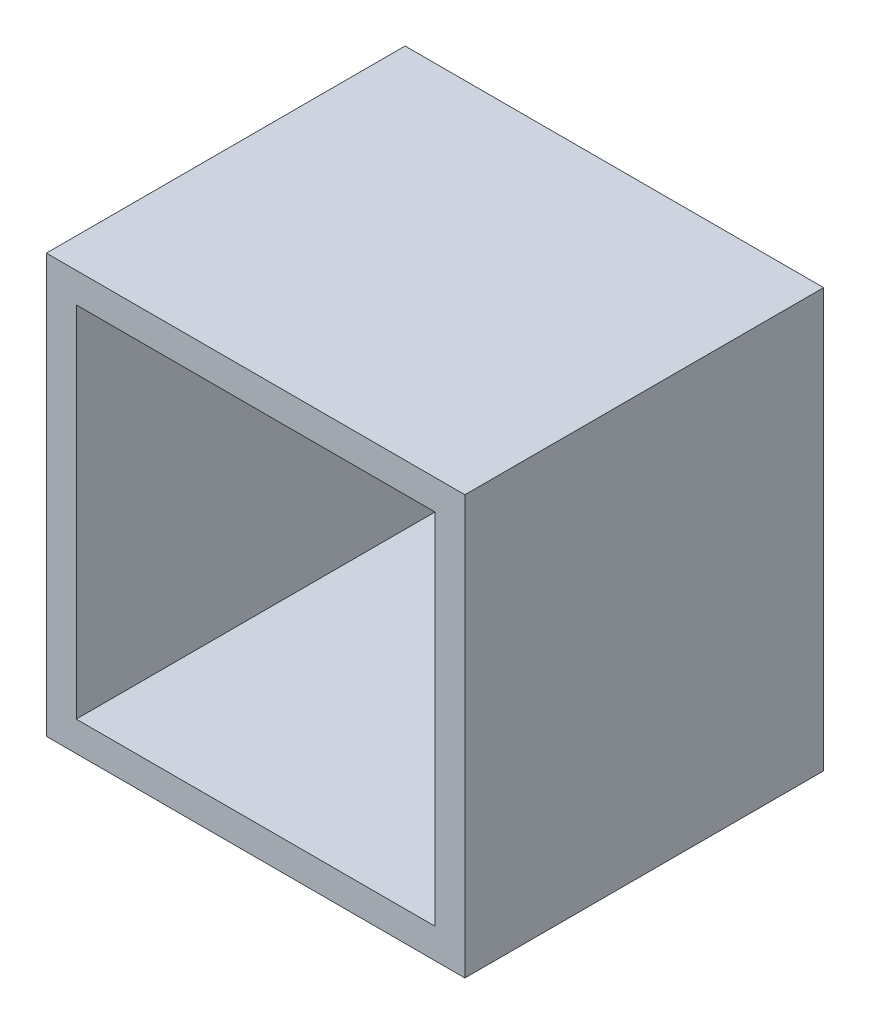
ISO-10303-21;
HEADER;
FILE_DESCRIPTION(('STEP AP214'),'2;1');
FILE_NAME('part.step','',(''),(''),'','','');
FILE_SCHEMA(('AUTOMOTIVE_DESIGN { 1 0 10303 214 1 1 1 1 }'));
ENDSEC;
DATA;
#1=APPLICATION_CONTEXT('core data for automotive mechanical design processes');
#2=APPLICATION_PROTOCOL_DEFINITION('international standard','automotive_design',2000,#1);
#3=PRODUCT_CONTEXT('',#1,'mechanical');
#4=PRODUCT('Part','Part','',(#3));
#5=PRODUCT_RELATED_PRODUCT_CATEGORY('part','',(#4));
#6=PRODUCT_DEFINITION_FORMATION('','',#4);
#7=PRODUCT_DEFINITION_CONTEXT('part definition',#1,'design');
#8=PRODUCT_DEFINITION('design','',#6,#7);
#9=PRODUCT_DEFINITION_SHAPE('','',#8);
#10=(LENGTH_UNIT() NAMED_UNIT(*) SI_UNIT(.MILLI.,.METRE.));
#11=(NAMED_UNIT(*) PLANE_ANGLE_UNIT() SI_UNIT($,.RADIAN.));
#12=(NAMED_UNIT(*) SI_UNIT($,.STERADIAN.) SOLID_ANGLE_UNIT());
#13=UNCERTAINTY_MEASURE_WITH_UNIT(LENGTH_MEASURE(1.E-05),#10,'distance_accuracy_value','');
#14=(GEOMETRIC_REPRESENTATION_CONTEXT(3) GLOBAL_UNCERTAINTY_ASSIGNED_CONTEXT((#13)) GLOBAL_UNIT_ASSIGNED_CONTEXT((#10,
#11,#12)) REPRESENTATION_CONTEXT('',''));
#15=CARTESIAN_POINT('',(0.,0.,0.));
#16=DIRECTION('',(0.,0.,1.));
#17=DIRECTION('',(1.,0.,0.));
#18=AXIS2_PLACEMENT_3D('',#15,#16,#17);
#19=CARTESIAN_POINT('',(177.8,-177.8,304.8));
#20=DIRECTION('',(0.,0.,1.));
#21=DIRECTION('',(1.,0.,0.));
#22=AXIS2_PLACEMENT_3D('',#19,#20,#21);
#23=PLANE('',#22);
#24=DIRECTION('',(0.,1.,0.));
#25=VECTOR('',#24,1.);
#26=CARTESIAN_POINT('',(177.8,177.8,304.8));
#27=LINE('',#26,#25);
#28=CARTESIAN_POINT('',(177.8,-177.8,304.8));
#29=VERTEX_POINT('',#28);
#30=CARTESIAN_POINT('',(177.8,177.8,304.8));
#31=VERTEX_POINT('',#30);
#32=EDGE_CURVE('E132',#29,#31,#27,.T.);
#33=ORIENTED_EDGE('',*,*,#32,.T.);
#34=DIRECTION('',(-1.,0.,0.));
#35=VECTOR('',#34,1.);
#36=CARTESIAN_POINT('',(-177.8,177.8,304.8));
#37=LINE('',#36,#35);
#38=CARTESIAN_POINT('',(-177.8,177.8,304.8));
#39=VERTEX_POINT('',#38);
#40=EDGE_CURVE('E135',#31,#39,#37,.T.);
#41=ORIENTED_EDGE('',*,*,#40,.T.);
#42=DIRECTION('',(0.,-1.,0.));
#43=VECTOR('',#42,1.);
#44=CARTESIAN_POINT('',(-177.8,177.8,304.8));
#45=LINE('',#44,#43);
#46=CARTESIAN_POINT('',(-177.8,-177.8,304.8));
#47=VERTEX_POINT('',#46);
#48=EDGE_CURVE('E138',#39,#47,#45,.T.);
#49=ORIENTED_EDGE('',*,*,#48,.T.);
#50=DIRECTION('',(1.,0.,0.));
#51=VECTOR('',#50,1.);
#52=CARTESIAN_POINT('',(-177.8,-177.8,304.8));
#53=LINE('',#52,#51);
#54=EDGE_CURVE('E140',#47,#29,#53,.T.);
#55=ORIENTED_EDGE('',*,*,#54,.T.);
#56=EDGE_LOOP('',(#33,#41,#49,#55));
#57=FACE_BOUND('',#56,.T.);
#58=DIRECTION('',(-1.,0.,0.));
#59=VECTOR('',#58,1.);
#60=CARTESIAN_POINT('',(-152.4,152.4,304.8));
#61=LINE('',#60,#59);
#62=CARTESIAN_POINT('',(152.4,152.4,304.8));
#63=VERTEX_POINT('',#62);
#64=CARTESIAN_POINT('',(-152.4,152.4,304.8));
#65=VERTEX_POINT('',#64);
#66=EDGE_CURVE('E104',#63,#65,#61,.T.);
#67=ORIENTED_EDGE('',*,*,#66,.F.);
#68=DIRECTION('',(0.,1.,0.));
#69=VECTOR('',#68,1.);
#70=CARTESIAN_POINT('',(152.4,152.4,304.8));
#71=LINE('',#70,#69);
#72=CARTESIAN_POINT('',(152.4,-152.4,304.8));
#73=VERTEX_POINT('',#72);
#74=EDGE_CURVE('E96',#73,#63,#71,.T.);
#75=ORIENTED_EDGE('',*,*,#74,.F.);
#76=DIRECTION('',(1.,0.,0.));
#77=VECTOR('',#76,1.);
#78=CARTESIAN_POINT('',(-152.4,-152.4,304.8));
#79=LINE('',#78,#77);
#80=CARTESIAN_POINT('',(-152.4,-152.4,304.8));
#81=VERTEX_POINT('',#80);
#82=EDGE_CURVE('E118',#81,#73,#79,.T.);
#83=ORIENTED_EDGE('',*,*,#82,.F.);
#84=DIRECTION('',(0.,-1.,0.));
#85=VECTOR('',#84,1.);
#86=CARTESIAN_POINT('',(-152.4,152.4,304.8));
#87=LINE('',#86,#85);
#88=EDGE_CURVE('E116',#65,#81,#87,.T.);
#89=ORIENTED_EDGE('',*,*,#88,.F.);
#90=EDGE_LOOP('',(#67,#75,#83,#89));
#91=FACE_BOUND('',#90,.T.);
#92=ADVANCED_FACE('F31',(#57,#91),#23,.T.);
#93=CARTESIAN_POINT('',(177.8,-177.8,0.));
#94=DIRECTION('',(0.,0.,1.));
#95=DIRECTION('',(1.,0.,0.));
#96=AXIS2_PLACEMENT_3D('',#93,#94,#95);
#97=PLANE('',#96);
#98=DIRECTION('',(0.,1.,0.));
#99=VECTOR('',#98,1.);
#100=CARTESIAN_POINT('',(177.8,177.8,0.));
#101=LINE('',#100,#99);
#102=CARTESIAN_POINT('',(177.8,-177.8,0.));
#103=VERTEX_POINT('',#102);
#104=CARTESIAN_POINT('',(177.8,177.8,0.));
#105=VERTEX_POINT('',#104);
#106=EDGE_CURVE('E112',#103,#105,#101,.T.);
#107=ORIENTED_EDGE('',*,*,#106,.F.);
#108=DIRECTION('',(1.,0.,0.));
#109=VECTOR('',#108,1.);
#110=CARTESIAN_POINT('',(-177.8,-177.8,0.));
#111=LINE('',#110,#109);
#112=CARTESIAN_POINT('',(-177.8,-177.8,0.));
#113=VERTEX_POINT('',#112);
#114=EDGE_CURVE('E136',#113,#103,#111,.T.);
#115=ORIENTED_EDGE('',*,*,#114,.F.);
#116=DIRECTION('',(0.,-1.,0.));
#117=VECTOR('',#116,1.);
#118=CARTESIAN_POINT('',(-177.8,177.8,0.));
#119=LINE('',#118,#117);
#120=CARTESIAN_POINT('',(-177.8,177.8,0.));
#121=VERTEX_POINT('',#120);
#122=EDGE_CURVE('E147',#121,#113,#119,.T.);
#123=ORIENTED_EDGE('',*,*,#122,.F.);
#124=DIRECTION('',(-1.,0.,0.));
#125=VECTOR('',#124,1.);
#126=CARTESIAN_POINT('',(-177.8,177.8,0.));
#127=LINE('',#126,#125);
#128=EDGE_CURVE('E145',#105,#121,#127,.T.);
#129=ORIENTED_EDGE('',*,*,#128,.F.);
#130=EDGE_LOOP('',(#107,#115,#123,#129));
#131=FACE_BOUND('',#130,.T.);
#132=DIRECTION('',(0.,1.,0.));
#133=VECTOR('',#132,1.);
#134=CARTESIAN_POINT('',(152.4,152.4,0.));
#135=LINE('',#134,#133);
#136=CARTESIAN_POINT('',(152.4,-152.4,0.));
#137=VERTEX_POINT('',#136);
#138=CARTESIAN_POINT('',(152.4,152.4,0.));
#139=VERTEX_POINT('',#138);
#140=EDGE_CURVE('E54',#137,#139,#135,.T.);
#141=ORIENTED_EDGE('',*,*,#140,.T.);
#142=DIRECTION('',(-1.,0.,0.));
#143=VECTOR('',#142,1.);
#144=CARTESIAN_POINT('',(-152.4,152.4,0.));
#145=LINE('',#144,#143);
#146=CARTESIAN_POINT('',(-152.4,152.4,0.));
#147=VERTEX_POINT('',#146);
#148=EDGE_CURVE('E111',#139,#147,#145,.T.);
#149=ORIENTED_EDGE('',*,*,#148,.T.);
#150=DIRECTION('',(0.,-1.,0.));
#151=VECTOR('',#150,1.);
#152=CARTESIAN_POINT('',(-152.4,152.4,0.));
#153=LINE('',#152,#151);
#154=CARTESIAN_POINT('',(-152.4,-152.4,0.));
#155=VERTEX_POINT('',#154);
#156=EDGE_CURVE('E124',#147,#155,#153,.T.);
#157=ORIENTED_EDGE('',*,*,#156,.T.);
#158=DIRECTION('',(1.,0.,0.));
#159=VECTOR('',#158,1.);
#160=CARTESIAN_POINT('',(-152.4,-152.4,0.));
#161=LINE('',#160,#159);
#162=EDGE_CURVE('E105',#155,#137,#161,.T.);
#163=ORIENTED_EDGE('',*,*,#162,.T.);
#164=EDGE_LOOP('',(#141,#149,#157,#163));
#165=FACE_BOUND('',#164,.T.);
#166=ADVANCED_FACE('F165',(#131,#165),#97,.F.);
#167=CARTESIAN_POINT('',(177.8,177.8,304.8));
#168=DIRECTION('',(-1.,0.,0.));
#169=DIRECTION('',(0.,0.,1.));
#170=AXIS2_PLACEMENT_3D('',#167,#168,#169);
#171=PLANE('',#170);
#172=ORIENTED_EDGE('',*,*,#106,.T.);
#173=DIRECTION('',(0.,0.,-1.));
#174=VECTOR('',#173,1.);
#175=CARTESIAN_POINT('',(177.8,177.8,304.8));
#176=LINE('',#175,#174);
#177=EDGE_CURVE('E11',#31,#105,#176,.T.);
#178=ORIENTED_EDGE('',*,*,#177,.F.);
#179=ORIENTED_EDGE('',*,*,#32,.F.);
#180=DIRECTION('',(0.,0.,-1.));
#181=VECTOR('',#180,1.);
#182=CARTESIAN_POINT('',(177.8,-177.8,304.8));
#183=LINE('',#182,#181);
#184=EDGE_CURVE('E142',#29,#103,#183,.T.);
#185=ORIENTED_EDGE('',*,*,#184,.T.);
#186=EDGE_LOOP('',(#172,#178,#179,#185));
#187=FACE_BOUND('',#186,.T.);
#188=ADVANCED_FACE('F33',(#187),#171,.F.);
#189=CARTESIAN_POINT('',(-177.8,177.8,304.8));
#190=DIRECTION('',(0.,-1.,0.));
#191=DIRECTION('',(0.,0.,-1.));
#192=AXIS2_PLACEMENT_3D('',#189,#190,#191);
#193=PLANE('',#192);
#194=ORIENTED_EDGE('',*,*,#128,.T.);
#195=DIRECTION('',(0.,0.,-1.));
#196=VECTOR('',#195,1.);
#197=CARTESIAN_POINT('',(-177.8,177.8,304.8));
#198=LINE('',#197,#196);
#199=EDGE_CURVE('E39',#39,#121,#198,.T.);
#200=ORIENTED_EDGE('',*,*,#199,.F.);
#201=ORIENTED_EDGE('',*,*,#40,.F.);
#202=ORIENTED_EDGE('',*,*,#177,.T.);
#203=EDGE_LOOP('',(#194,#200,#201,#202));
#204=FACE_BOUND('',#203,.T.);
#205=ADVANCED_FACE('F175',(#204),#193,.F.);
#206=CARTESIAN_POINT('',(-177.8,177.8,304.8));
#207=DIRECTION('',(1.,0.,0.));
#208=DIRECTION('',(0.,0.,-1.));
#209=AXIS2_PLACEMENT_3D('',#206,#207,#208);
#210=PLANE('',#209);
#211=ORIENTED_EDGE('',*,*,#122,.T.);
#212=DIRECTION('',(0.,0.,-1.));
#213=VECTOR('',#212,1.);
#214=CARTESIAN_POINT('',(-177.8,-177.8,304.8));
#215=LINE('',#214,#213);
#216=EDGE_CURVE('E152',#47,#113,#215,.T.);
#217=ORIENTED_EDGE('',*,*,#216,.F.);
#218=ORIENTED_EDGE('',*,*,#48,.F.);
#219=ORIENTED_EDGE('',*,*,#199,.T.);
#220=EDGE_LOOP('',(#211,#217,#218,#219));
#221=FACE_BOUND('',#220,.T.);
#222=ADVANCED_FACE('F159',(#221),#210,.F.);
#223=CARTESIAN_POINT('',(-177.8,-177.8,304.8));
#224=DIRECTION('',(0.,1.,0.));
#225=DIRECTION('',(0.,0.,1.));
#226=AXIS2_PLACEMENT_3D('',#223,#224,#225);
#227=PLANE('',#226);
#228=ORIENTED_EDGE('',*,*,#114,.T.);
#229=ORIENTED_EDGE('',*,*,#184,.F.);
#230=ORIENTED_EDGE('',*,*,#54,.F.);
#231=ORIENTED_EDGE('',*,*,#216,.T.);
#232=EDGE_LOOP('',(#228,#229,#230,#231));
#233=FACE_BOUND('',#232,.T.);
#234=ADVANCED_FACE('F169',(#233),#227,.F.);
#235=CARTESIAN_POINT('',(152.4,152.4,304.8));
#236=DIRECTION('',(-1.,0.,0.));
#237=DIRECTION('',(0.,0.,1.));
#238=AXIS2_PLACEMENT_3D('',#235,#236,#237);
#239=PLANE('',#238);
#240=ORIENTED_EDGE('',*,*,#140,.F.);
#241=DIRECTION('',(0.,0.,-1.));
#242=VECTOR('',#241,1.);
#243=CARTESIAN_POINT('',(152.4,-152.4,304.8));
#244=LINE('',#243,#242);
#245=EDGE_CURVE('E100',#73,#137,#244,.T.);
#246=ORIENTED_EDGE('',*,*,#245,.F.);
#247=ORIENTED_EDGE('',*,*,#74,.T.);
#248=DIRECTION('',(0.,0.,-1.));
#249=VECTOR('',#248,1.);
#250=CARTESIAN_POINT('',(152.4,152.4,304.8));
#251=LINE('',#250,#249);
#252=EDGE_CURVE('E99',#63,#139,#251,.T.);
#253=ORIENTED_EDGE('',*,*,#252,.T.);
#254=EDGE_LOOP('',(#240,#246,#247,#253));
#255=FACE_BOUND('',#254,.T.);
#256=ADVANCED_FACE('F98',(#255),#239,.T.);
#257=CARTESIAN_POINT('',(-152.4,152.4,304.8));
#258=DIRECTION('',(0.,-1.,0.));
#259=DIRECTION('',(0.,0.,-1.));
#260=AXIS2_PLACEMENT_3D('',#257,#258,#259);
#261=PLANE('',#260);
#262=ORIENTED_EDGE('',*,*,#148,.F.);
#263=ORIENTED_EDGE('',*,*,#252,.F.);
#264=ORIENTED_EDGE('',*,*,#66,.T.);
#265=DIRECTION('',(0.,0.,-1.));
#266=VECTOR('',#265,1.);
#267=CARTESIAN_POINT('',(-152.4,152.4,304.8));
#268=LINE('',#267,#266);
#269=EDGE_CURVE('E113',#65,#147,#268,.T.);
#270=ORIENTED_EDGE('',*,*,#269,.T.);
#271=EDGE_LOOP('',(#262,#263,#264,#270));
#272=FACE_BOUND('',#271,.T.);
#273=ADVANCED_FACE('F108',(#272),#261,.T.);
#274=CARTESIAN_POINT('',(-152.4,152.4,304.8));
#275=DIRECTION('',(1.,0.,0.));
#276=DIRECTION('',(0.,0.,-1.));
#277=AXIS2_PLACEMENT_3D('',#274,#275,#276);
#278=PLANE('',#277);
#279=ORIENTED_EDGE('',*,*,#156,.F.);
#280=ORIENTED_EDGE('',*,*,#269,.F.);
#281=ORIENTED_EDGE('',*,*,#88,.T.);
#282=DIRECTION('',(0.,0.,-1.));
#283=VECTOR('',#282,1.);
#284=CARTESIAN_POINT('',(-152.4,-152.4,304.8));
#285=LINE('',#284,#283);
#286=EDGE_CURVE('E46',#81,#155,#285,.T.);
#287=ORIENTED_EDGE('',*,*,#286,.T.);
#288=EDGE_LOOP('',(#279,#280,#281,#287));
#289=FACE_BOUND('',#288,.T.);
#290=ADVANCED_FACE('F198',(#289),#278,.T.);
#291=CARTESIAN_POINT('',(-152.4,-152.4,304.8));
#292=DIRECTION('',(0.,1.,0.));
#293=DIRECTION('',(0.,0.,1.));
#294=AXIS2_PLACEMENT_3D('',#291,#292,#293);
#295=PLANE('',#294);
#296=ORIENTED_EDGE('',*,*,#162,.F.);
#297=ORIENTED_EDGE('',*,*,#286,.F.);
#298=ORIENTED_EDGE('',*,*,#82,.T.);
#299=ORIENTED_EDGE('',*,*,#245,.T.);
#300=EDGE_LOOP('',(#296,#297,#298,#299));
#301=FACE_BOUND('',#300,.T.);
#302=ADVANCED_FACE('F202',(#301),#295,.T.);
#303=CLOSED_SHELL('',(#92,#166,#188,#205,#222,#234,#256,#273,#290,#302));
#304=MANIFOLD_SOLID_BREP('B2',#303);
#305=ADVANCED_BREP_SHAPE_REPRESENTATION('',(#18,#304),#14);
#306=SHAPE_DEFINITION_REPRESENTATION(#9,#305);
ENDSEC;
END-ISO-10303-21;
